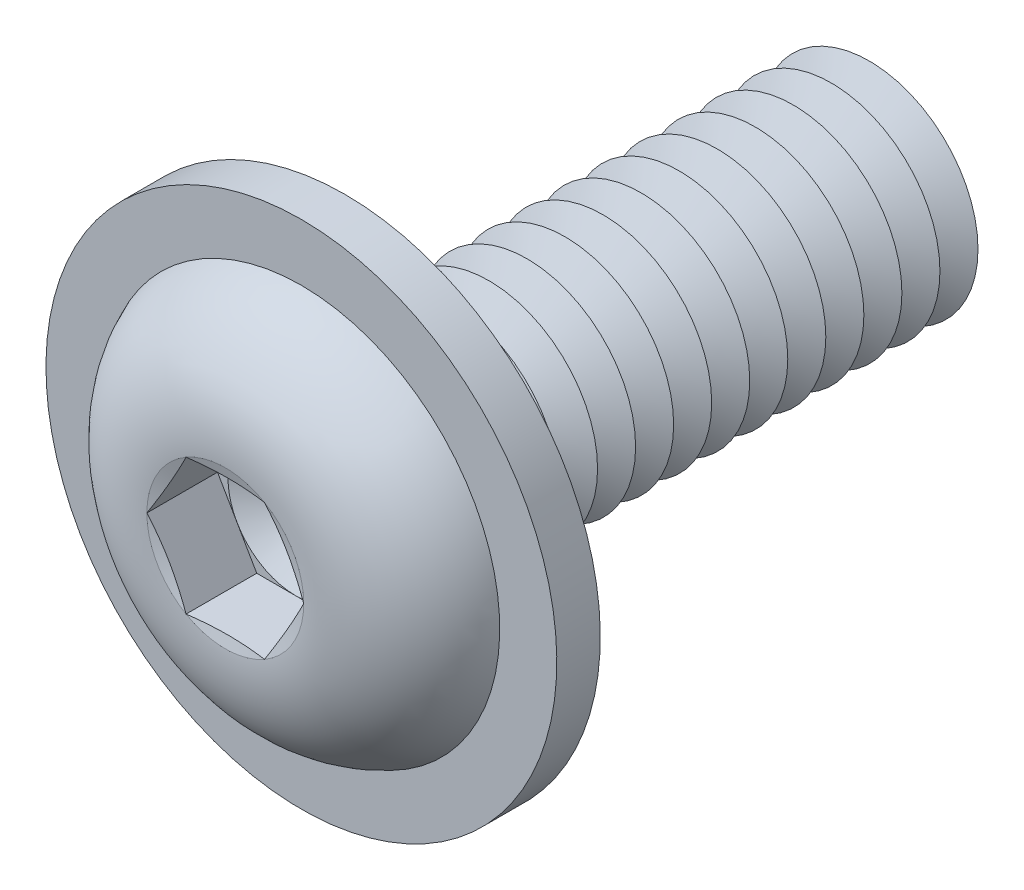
from build123d import *

# Parameters (mm, degrees)
FILLET1_R           = 0.35
LPATTERN1_COUNT     = 14
LPATTERN1_PITCH     = 0.7
CUT_EXTRUDE1_DEPTH  = 1.3
SKETCH5_R           = 4.7
SKETCH5_R_2         = 2.35
BOSS_EXTRUDE1_DEPTH = 0.8


with BuildPart() as part:
    # Sketch1 → Revolve1 (revolve)
    with BuildSketch(Plane(origin=(0, 0, 0), x_dir=(0, 0, -1), z_dir=(1, 0, 0)), mode=Mode.PRIVATE) as revolve1_sk:
        with BuildLine():
            Line((0, 2), (0, 3.8))
            ThreePointArc((0, 3.8), (-1.611961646, 3.099623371), (-2.2, 1.443375))
            Line((-2.2, 1.443375), (-2.006624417, 0.7216875))
            Line((-2.006624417, 0.7216875), (-2.2, 0.7216875))
            Line((-2.2, 0.7216875), (-2.2, 0))
            Line((-2.2, 0), (10, 0))
            Line((10, 0), (10, 2))
            Line((10, 2), (0, 2))
        make_face()
    revolve(revolve1_sk.sketch.rotate(Axis((0, 0, -10), (0, 0, 1)), 90), axis=Axis((0, 0, -10), (0, 0, 1)))

    # Fillet1
    fillet1_edges = [part.edges().sort_by_distance(p)[0] for p in [
        (2, 0, 0),
    ]]
    fillet(fillet1_edges, radius=FILLET1_R)

    # Sketch2 → Cut-Revolve1 (revolve, cut)
    with BuildSketch(Plane(origin=(0, 0, 0), x_dir=(0, 0, -1), z_dir=(1, 0, 0)), mode=Mode.PRIVATE) as cut_revolve1_sk:
        Polygon((9.65, 2), (10.35, 2), (10, 1.393782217), align=None)
    cut_revolve1 = revolve(cut_revolve1_sk.sketch.rotate(Axis((0, 0, -10), (0, 0, -1)), 270), axis=Axis((0, 0, -10), (0, 0, -1)), mode=Mode.SUBTRACT)

    # LPattern1: Cut-Revolve1 ×14
    with Locations(*[(0, 0, i * LPATTERN1_PITCH) for i in range(1, LPATTERN1_COUNT)]):
        add(cut_revolve1, mode=Mode.SUBTRACT)

    # Sketch3 → Cut-Extrude1 (cut)
    with BuildSketch(Plane.XY.offset(2.2)):
        Polygon((0.7216875, 1.249999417), (-0.7216875, 1.249999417), (-1.443375, 0), (-0.7216875, -1.249999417), (0.7216875, -1.249999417), (1.443375, 0), align=None)
    extrude(amount=-CUT_EXTRUDE1_DEPTH, mode=Mode.SUBTRACT)

    # Cut-Extrude2 cone 1 section (on through the dimple's axis) → Cut-Extrude2 (revolve, cut)
    with BuildSketch(Plane(origin=(0, 0, 0.9), x_dir=(0, -1, 0), z_dir=(1, 0, 0))):
        Polygon((0, 0), (1.249999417, 0), (0, 0.7216875), align=None)
    revolve(axis=Axis((0, 0, 0.9), (0, 0, -1)), mode=Mode.SUBTRACT)

    # Sketch5 → Boss-Extrude1 (add)
    with BuildSketch(Plane(origin=(0, 0, 0), x_dir=(-1, 0, 0), z_dir=(0, 0, -1))):
        with Locations(Location((0, 0, 0), (0, 0, 90))):
            Circle(SKETCH5_R)
        Circle(SKETCH5_R_2, mode=Mode.SUBTRACT)
    extrude(amount=-BOSS_EXTRUDE1_DEPTH)


solid = part.part
